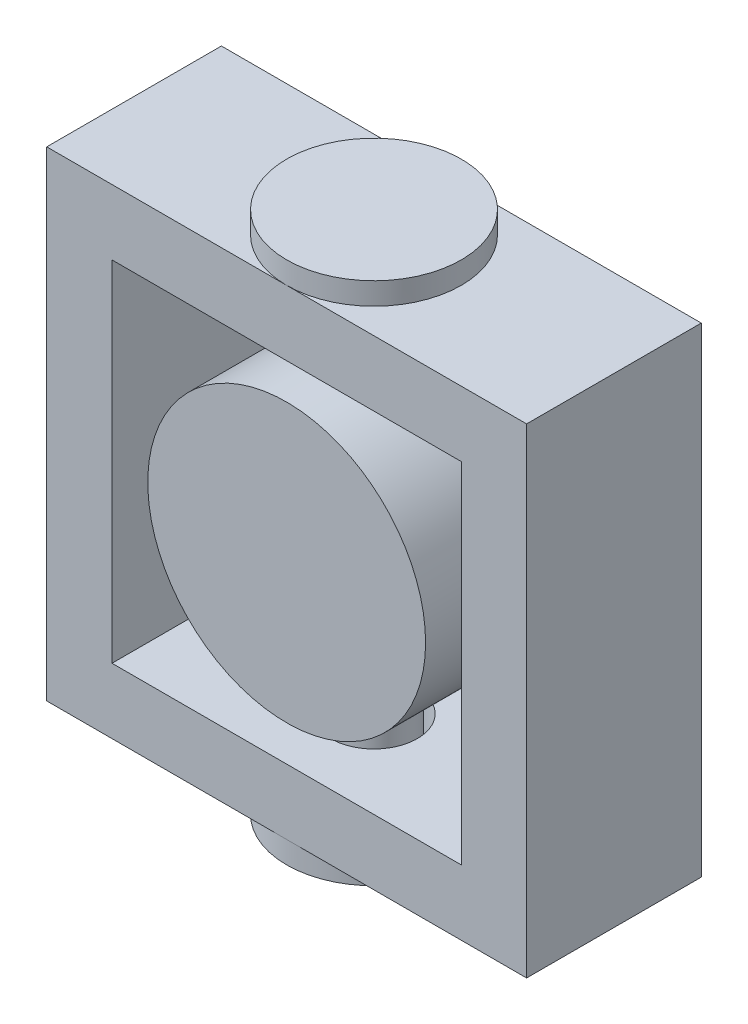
from build123d import *

# Parameters (mm, degrees)
SKETCH1_W           = 27.474317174
SKETCH1_H           = 27.474317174
SKETCH1_W_2         = 20
SKETCH1_H_2         = 20
BOSS_EXTRUDE1_DEPTH = 10
SKETCH3_R           = 7.953139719
BOSS_EXTRUDE2_DEPTH = 10
SKETCH5_R           = 2.478151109
CUT_EXTRUDE1_DEPTH  = 29
SKETCH6_R           = 2
BOSS_EXTRUDE3_DEPTH = 30
SKETCH7_R           = 5
BOSS_EXTRUDE4_DEPTH = 2


with BuildPart() as part:
    # Sketch1 → Boss-Extrude1 (new body)
    with BuildSketch(Plane.XY):
        Rectangle(SKETCH1_W, SKETCH1_H)
        Rectangle(SKETCH1_W_2, SKETCH1_H_2, mode=Mode.SUBTRACT)
    extrude(amount=BOSS_EXTRUDE1_DEPTH)


with BuildPart() as body_2:
    # Sketch3 → Boss-Extrude2 (new body)
    with BuildSketch(Plane.XY.offset(10)):
        Circle(SKETCH3_R)
    extrude(amount=-BOSS_EXTRUDE2_DEPTH)


with BuildPart() as cut_extrude1_tool:
    # Sketch5 → Cut-Extrude1 (new body)
    with BuildSketch(Plane.XZ.offset(13.737158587)):
        with Locations(Location((0, 5, 0), (0, 0, 270))):
            Circle(SKETCH5_R)
    extrude(amount=-CUT_EXTRUDE1_DEPTH)


with BuildPart() as part_1:
    add(part.part)

    # Cut-Extrude1: cut by cut_extrude1_tool
    add(cut_extrude1_tool.part, mode=Mode.SUBTRACT)



with BuildPart() as body_2_1:
    add(body_2.part)

    # Cut-Extrude1: cut by cut_extrude1_tool
    add(cut_extrude1_tool.part, mode=Mode.SUBTRACT)


with BuildPart() as body_3:
    # Sketch6 → Boss-Extrude3 (new body)
    with BuildSketch(Plane(origin=(0, -15, 0), x_dir=(1, 0, 0), z_dir=(0, 1, 0))):
        with Locations(Location((0, -5, 0), (0, 0, 270))):
            Circle(SKETCH6_R)
    extrude(amount=BOSS_EXTRUDE3_DEPTH)


with BuildPart() as part_2:
    add(part_1.part)

    add(body_3.part)  # Boss-Extrude4 merges body 3
    # Sketch7 → Boss-Extrude4 (add)
    with BuildSketch(Plane(origin=(0, -15, 0), x_dir=(1, 0, 0), z_dir=(0, 1, 0))):
        with Locations(Location((0, -5, 0), (0, 0, 270))):
            Circle(SKETCH7_R)
    boss_extrude4 = extrude(amount=BOSS_EXTRUDE4_DEPTH)

    # Mirror4: Boss-Extrude4 across plane
    add(boss_extrude4.mirror(Plane.ZX))


solid = Compound([body_2_1.part, part_2.part])
